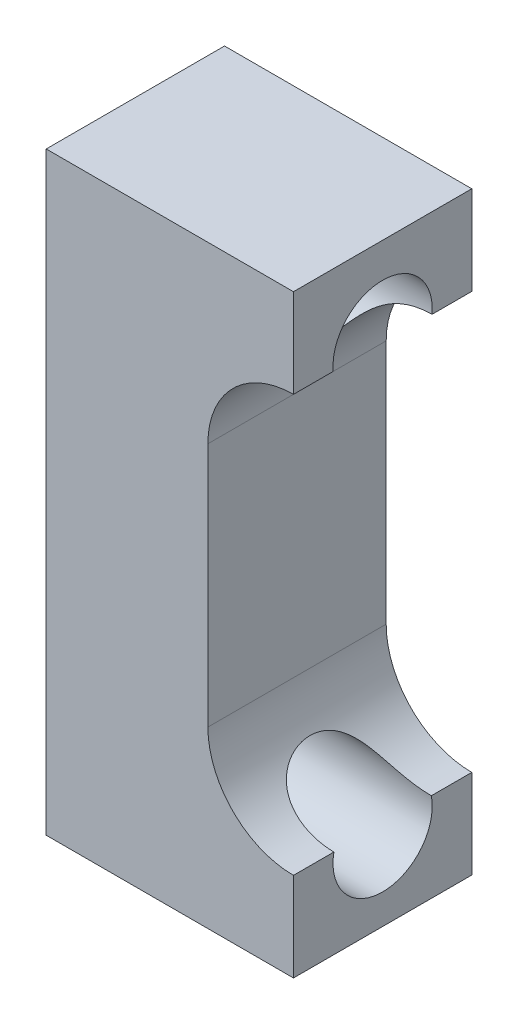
ISO-10303-21;
HEADER;
FILE_DESCRIPTION(('STEP AP214'),'2;1');
FILE_NAME('part.step','',(''),(''),'','','');
FILE_SCHEMA(('AUTOMOTIVE_DESIGN { 1 0 10303 214 1 1 1 1 }'));
ENDSEC;
DATA;
#1=APPLICATION_CONTEXT('core data for automotive mechanical design processes');
#2=APPLICATION_PROTOCOL_DEFINITION('international standard','automotive_design',2000,#1);
#3=PRODUCT_CONTEXT('',#1,'mechanical');
#4=PRODUCT('Part','Part','',(#3));
#5=PRODUCT_RELATED_PRODUCT_CATEGORY('part','',(#4));
#6=PRODUCT_DEFINITION_FORMATION('','',#4);
#7=PRODUCT_DEFINITION_CONTEXT('part definition',#1,'design');
#8=PRODUCT_DEFINITION('design','',#6,#7);
#9=PRODUCT_DEFINITION_SHAPE('','',#8);
#10=(LENGTH_UNIT() NAMED_UNIT(*) SI_UNIT(.MILLI.,.METRE.));
#11=(NAMED_UNIT(*) PLANE_ANGLE_UNIT() SI_UNIT($,.RADIAN.));
#12=(NAMED_UNIT(*) SI_UNIT($,.STERADIAN.) SOLID_ANGLE_UNIT());
#13=UNCERTAINTY_MEASURE_WITH_UNIT(LENGTH_MEASURE(1.E-05),#10,'distance_accuracy_value','');
#14=(GEOMETRIC_REPRESENTATION_CONTEXT(3) GLOBAL_UNCERTAINTY_ASSIGNED_CONTEXT((#13)) GLOBAL_UNIT_ASSIGNED_CONTEXT((#10,
#11,#12)) REPRESENTATION_CONTEXT('',''));
#15=CARTESIAN_POINT('',(0.,0.,0.));
#16=DIRECTION('',(0.,0.,1.));
#17=DIRECTION('',(1.,0.,0.));
#18=AXIS2_PLACEMENT_3D('',#15,#16,#17);
#19=CARTESIAN_POINT('',(11.9999999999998,15.9999999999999,4.7625));
#20=DIRECTION('',(-1.,0.,0.));
#21=DIRECTION('',(0.,-1.,0.));
#22=AXIS2_PLACEMENT_3D('',#19,#20,#21);
#23=PLANE('',#22);
#24=DIRECTION('',(0.,1.,0.));
#25=VECTOR('',#24,1.);
#26=CARTESIAN_POINT('',(12.,16.,-4.7625));
#27=LINE('',#26,#25);
#28=CARTESIAN_POINT('',(12.,-15.75,-4.7625));
#29=VERTEX_POINT('',#28);
#30=CARTESIAN_POINT('',(12.,-11.0002,-4.76249999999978));
#31=VERTEX_POINT('',#30);
#32=EDGE_CURVE('E148',#29,#31,#27,.T.);
#33=ORIENTED_EDGE('',*,*,#32,.T.);
#34=DIRECTION('',(0.,0.,1.));
#35=VECTOR('',#34,1.);
#36=CARTESIAN_POINT('',(12.,-11.0002,-4.76249999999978));
#37=LINE('',#36,#35);
#38=CARTESIAN_POINT('',(11.9999999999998,-11.0002,-2.60244115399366));
#39=VERTEX_POINT('',#38);
#40=EDGE_CURVE('E232',#31,#39,#37,.T.);
#41=ORIENTED_EDGE('',*,*,#40,.T.);
#42=CARTESIAN_POINT('',(12.,-11.5,1.11022302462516E-13));
#43=DIRECTION('',(-1.,0.,0.));
#44=DIRECTION('',(0.,0.,1.));
#45=AXIS2_PLACEMENT_3D('',#42,#43,#44);
#46=CIRCLE('',#45,2.64999999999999);
#47=CARTESIAN_POINT('',(12.0000000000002,-11.0002,2.60244115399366));
#48=VERTEX_POINT('',#47);
#49=EDGE_CURVE('E242',#39,#48,#46,.T.);
#50=ORIENTED_EDGE('',*,*,#49,.T.);
#51=CARTESIAN_POINT('',(11.9999999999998,-11.0002,4.7625));
#52=VERTEX_POINT('',#51);
#53=EDGE_CURVE('E234',#48,#52,#37,.T.);
#54=ORIENTED_EDGE('',*,*,#53,.T.);
#55=DIRECTION('',(0.,1.,0.));
#56=VECTOR('',#55,1.);
#57=CARTESIAN_POINT('',(11.9999999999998,15.9999999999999,4.7625));
#58=LINE('',#57,#56);
#59=CARTESIAN_POINT('',(12.,-15.75,4.76250000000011));
#60=VERTEX_POINT('',#59);
#61=EDGE_CURVE('E159',#60,#52,#58,.T.);
#62=ORIENTED_EDGE('',*,*,#61,.F.);
#63=DIRECTION('',(0.,0.,-1.));
#64=VECTOR('',#63,1.);
#65=CARTESIAN_POINT('',(12.,-15.75,4.76250000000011));
#66=LINE('',#65,#64);
#67=EDGE_CURVE('E158',#60,#29,#66,.T.);
#68=ORIENTED_EDGE('',*,*,#67,.T.);
#69=EDGE_LOOP('',(#33,#41,#50,#54,#62,#68));
#70=FACE_BOUND('',#69,.T.);
#71=ADVANCED_FACE('F38',(#70),#23,.F.);
#72=CARTESIAN_POINT('',(0.,16.,4.7625));
#73=DIRECTION('',(0.,-1.,0.));
#74=DIRECTION('',(0.,0.,-1.));
#75=AXIS2_PLACEMENT_3D('',#72,#73,#74);
#76=PLANE('',#75);
#77=DIRECTION('',(-1.,0.,0.));
#78=VECTOR('',#77,1.);
#79=CARTESIAN_POINT('',(0.,16.,-4.76249999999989));
#80=LINE('',#79,#78);
#81=CARTESIAN_POINT('',(12.,16.,-4.7625));
#82=VERTEX_POINT('',#81);
#83=CARTESIAN_POINT('',(-1.2080000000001,16.,-4.76249999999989));
#84=VERTEX_POINT('',#83);
#85=EDGE_CURVE('E146',#82,#84,#80,.T.);
#86=ORIENTED_EDGE('',*,*,#85,.T.);
#87=DIRECTION('',(0.,0.,-1.));
#88=VECTOR('',#87,1.);
#89=CARTESIAN_POINT('',(-1.2080000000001,16.,4.7625));
#90=LINE('',#89,#88);
#91=CARTESIAN_POINT('',(-1.2080000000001,16.,4.7625));
#92=VERTEX_POINT('',#91);
#93=EDGE_CURVE('E165',#92,#84,#90,.T.);
#94=ORIENTED_EDGE('',*,*,#93,.F.);
#95=DIRECTION('',(-1.,0.,0.));
#96=VECTOR('',#95,1.);
#97=CARTESIAN_POINT('',(0.,16.,4.7625));
#98=LINE('',#97,#96);
#99=CARTESIAN_POINT('',(11.9999999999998,15.9999999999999,4.7625));
#100=VERTEX_POINT('',#99);
#101=EDGE_CURVE('E93',#100,#92,#98,.T.);
#102=ORIENTED_EDGE('',*,*,#101,.F.);
#103=DIRECTION('',(0.,0.,-1.));
#104=VECTOR('',#103,1.);
#105=CARTESIAN_POINT('',(11.9999999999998,15.9999999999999,4.7625));
#106=LINE('',#105,#104);
#107=EDGE_CURVE('E156',#100,#82,#106,.T.);
#108=ORIENTED_EDGE('',*,*,#107,.T.);
#109=EDGE_LOOP('',(#86,#94,#102,#108));
#110=FACE_BOUND('',#109,.T.);
#111=ADVANCED_FACE('F40',(#110),#76,.F.);
#112=CARTESIAN_POINT('',(-1.2080000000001,16.,4.7625));
#113=DIRECTION('',(1.,0.,0.));
#114=DIRECTION('',(0.,1.,0.));
#115=AXIS2_PLACEMENT_3D('',#112,#113,#114);
#116=PLANE('',#115);
#117=CARTESIAN_POINT('',(-1.20800000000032,11.5,1.11022302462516E-13));
#118=DIRECTION('',(1.,0.,0.));
#119=DIRECTION('',(0.,1.,0.));
#120=AXIS2_PLACEMENT_3D('',#117,#118,#119);
#121=CIRCLE('',#120,2.64999999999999);
#122=CARTESIAN_POINT('',(-1.20800000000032,14.15,1.11084362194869E-13));
#123=VERTEX_POINT('',#122);
#124=EDGE_CURVE('E239',#123,#123,#121,.T.);
#125=ORIENTED_EDGE('',*,*,#124,.T.);
#126=EDGE_LOOP('',(#125));
#127=FACE_BOUND('',#126,.T.);
#128=CARTESIAN_POINT('',(-1.20799999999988,-11.5,1.11022302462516E-13));
#129=DIRECTION('',(1.,0.,0.));
#130=DIRECTION('',(0.,1.,0.));
#131=AXIS2_PLACEMENT_3D('',#128,#129,#130);
#132=CIRCLE('',#131,2.64999999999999);
#133=CARTESIAN_POINT('',(-1.20799999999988,-8.84999999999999,1.11084362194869E-13));
#134=VERTEX_POINT('',#133);
#135=EDGE_CURVE('E245',#134,#134,#132,.T.);
#136=ORIENTED_EDGE('',*,*,#135,.T.);
#137=EDGE_LOOP('',(#136));
#138=FACE_BOUND('',#137,.T.);
#139=DIRECTION('',(0.,-1.,0.));
#140=VECTOR('',#139,1.);
#141=CARTESIAN_POINT('',(-1.2080000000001,16.,-4.76249999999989));
#142=LINE('',#141,#140);
#143=CARTESIAN_POINT('',(-1.20799999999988,-15.75,-4.76249999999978));
#144=VERTEX_POINT('',#143);
#145=EDGE_CURVE('E152',#84,#144,#142,.T.);
#146=ORIENTED_EDGE('',*,*,#145,.T.);
#147=DIRECTION('',(0.,0.,-1.));
#148=VECTOR('',#147,1.);
#149=CARTESIAN_POINT('',(-1.2080000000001,-15.75,4.76250000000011));
#150=LINE('',#149,#148);
#151=CARTESIAN_POINT('',(-1.2080000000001,-15.75,4.76250000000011));
#152=VERTEX_POINT('',#151);
#153=EDGE_CURVE('E162',#152,#144,#150,.T.);
#154=ORIENTED_EDGE('',*,*,#153,.F.);
#155=DIRECTION('',(0.,-1.,0.));
#156=VECTOR('',#155,1.);
#157=CARTESIAN_POINT('',(-1.2080000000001,16.,4.7625));
#158=LINE('',#157,#156);
#159=EDGE_CURVE('E249',#92,#152,#158,.T.);
#160=ORIENTED_EDGE('',*,*,#159,.F.);
#161=ORIENTED_EDGE('',*,*,#93,.T.);
#162=EDGE_LOOP('',(#146,#154,#160,#161));
#163=FACE_BOUND('',#162,.T.);
#164=ADVANCED_FACE('F195',(#127,#138,#163),#116,.F.);
#165=CARTESIAN_POINT('',(0.,-15.75,4.7625));
#166=DIRECTION('',(0.,1.,0.));
#167=DIRECTION('',(0.,0.,1.));
#168=AXIS2_PLACEMENT_3D('',#165,#166,#167);
#169=PLANE('',#168);
#170=DIRECTION('',(1.,0.,0.));
#171=VECTOR('',#170,1.);
#172=CARTESIAN_POINT('',(0.,-15.75,-4.76249999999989));
#173=LINE('',#172,#171);
#174=EDGE_CURVE('E149',#144,#29,#173,.T.);
#175=ORIENTED_EDGE('',*,*,#174,.T.);
#176=ORIENTED_EDGE('',*,*,#67,.F.);
#177=DIRECTION('',(1.,0.,0.));
#178=VECTOR('',#177,1.);
#179=CARTESIAN_POINT('',(-1.2080000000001,-15.75,4.76250000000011));
#180=LINE('',#179,#178);
#181=EDGE_CURVE('E251',#152,#60,#180,.T.);
#182=ORIENTED_EDGE('',*,*,#181,.F.);
#183=ORIENTED_EDGE('',*,*,#153,.T.);
#184=EDGE_LOOP('',(#175,#176,#182,#183));
#185=FACE_BOUND('',#184,.T.);
#186=ADVANCED_FACE('F201',(#185),#169,.F.);
#187=CARTESIAN_POINT('',(12.,11.2502,4.7625));
#188=VERTEX_POINT('',#187);
#189=EDGE_CURVE('E67',#188,#100,#58,.T.);
#190=ORIENTED_EDGE('',*,*,#189,.F.);
#191=DIRECTION('',(0.,0.,1.));
#192=VECTOR('',#191,1.);
#193=CARTESIAN_POINT('',(12.,11.2502,-4.76249999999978));
#194=LINE('',#193,#192);
#195=CARTESIAN_POINT('',(12.,11.2502,2.63820013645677));
#196=VERTEX_POINT('',#195);
#197=EDGE_CURVE('E141',#196,#188,#194,.T.);
#198=ORIENTED_EDGE('',*,*,#197,.F.);
#199=CARTESIAN_POINT('',(12.,11.5,1.11022302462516E-13));
#200=DIRECTION('',(-1.,0.,0.));
#201=DIRECTION('',(0.,0.,1.));
#202=AXIS2_PLACEMENT_3D('',#199,#200,#201);
#203=CIRCLE('',#202,2.64999999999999);
#204=CARTESIAN_POINT('',(12.,11.2502,-2.63820013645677));
#205=VERTEX_POINT('',#204);
#206=EDGE_CURVE('E140',#196,#205,#203,.T.);
#207=ORIENTED_EDGE('',*,*,#206,.T.);
#208=CARTESIAN_POINT('',(12.,11.2502,-4.76249999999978));
#209=VERTEX_POINT('',#208);
#210=EDGE_CURVE('E58',#209,#205,#194,.T.);
#211=ORIENTED_EDGE('',*,*,#210,.F.);
#212=EDGE_CURVE('E88',#209,#82,#27,.T.);
#213=ORIENTED_EDGE('',*,*,#212,.T.);
#214=ORIENTED_EDGE('',*,*,#107,.F.);
#215=EDGE_LOOP('',(#190,#198,#207,#211,#213,#214));
#216=FACE_BOUND('',#215,.T.);
#217=ADVANCED_FACE('F137',(#216),#23,.F.);
#218=CARTESIAN_POINT('',(11.9999999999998,15.9999999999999,4.7625));
#219=DIRECTION('',(0.,0.,-1.));
#220=DIRECTION('',(-1.,0.,0.));
#221=AXIS2_PLACEMENT_3D('',#218,#219,#220);
#222=PLANE('',#221);
#223=ORIENTED_EDGE('',*,*,#61,.T.);
#224=CARTESIAN_POINT('',(12.,-6.42819999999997,4.76249999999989));
#225=DIRECTION('',(0.,0.,1.));
#226=DIRECTION('',(1.,0.,0.));
#227=AXIS2_PLACEMENT_3D('',#224,#225,#226);
#228=CIRCLE('',#227,4.572);
#229=CARTESIAN_POINT('',(7.42799999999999,-6.42820000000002,4.7625));
#230=VERTEX_POINT('',#229);
#231=EDGE_CURVE('E134',#230,#52,#228,.T.);
#232=ORIENTED_EDGE('',*,*,#231,.F.);
#233=DIRECTION('',(0.,-1.,0.));
#234=VECTOR('',#233,1.);
#235=CARTESIAN_POINT('',(7.42799999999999,6.67819999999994,4.7625));
#236=LINE('',#235,#234);
#237=CARTESIAN_POINT('',(7.42799999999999,6.67819999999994,4.7625));
#238=VERTEX_POINT('',#237);
#239=EDGE_CURVE('E228',#238,#230,#236,.T.);
#240=ORIENTED_EDGE('',*,*,#239,.F.);
#241=CARTESIAN_POINT('',(12.0000000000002,6.6782,4.76250000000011));
#242=DIRECTION('',(0.,0.,1.));
#243=DIRECTION('',(1.,0.,0.));
#244=AXIS2_PLACEMENT_3D('',#241,#242,#243);
#245=CIRCLE('',#244,4.572);
#246=EDGE_CURVE('E226',#188,#238,#245,.T.);
#247=ORIENTED_EDGE('',*,*,#246,.F.);
#248=ORIENTED_EDGE('',*,*,#189,.T.);
#249=ORIENTED_EDGE('',*,*,#101,.T.);
#250=ORIENTED_EDGE('',*,*,#159,.T.);
#251=ORIENTED_EDGE('',*,*,#181,.T.);
#252=EDGE_LOOP('',(#223,#232,#240,#247,#248,#249,#250,#251));
#253=FACE_BOUND('',#252,.T.);
#254=ADVANCED_FACE('F200',(#253),#222,.F.);
#255=CARTESIAN_POINT('',(12.,16.,-4.7625));
#256=DIRECTION('',(0.,0.,-1.));
#257=DIRECTION('',(-1.,0.,0.));
#258=AXIS2_PLACEMENT_3D('',#255,#256,#257);
#259=PLANE('',#258);
#260=CARTESIAN_POINT('',(12.,-6.42820000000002,-4.76249999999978));
#261=DIRECTION('',(0.,0.,1.));
#262=DIRECTION('',(1.,0.,0.));
#263=AXIS2_PLACEMENT_3D('',#260,#261,#262);
#264=CIRCLE('',#263,4.572);
#265=CARTESIAN_POINT('',(7.42799999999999,-6.42820000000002,-4.76249999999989));
#266=VERTEX_POINT('',#265);
#267=EDGE_CURVE('E222',#266,#31,#264,.T.);
#268=ORIENTED_EDGE('',*,*,#267,.T.);
#269=ORIENTED_EDGE('',*,*,#32,.F.);
#270=ORIENTED_EDGE('',*,*,#174,.F.);
#271=ORIENTED_EDGE('',*,*,#145,.F.);
#272=ORIENTED_EDGE('',*,*,#85,.F.);
#273=ORIENTED_EDGE('',*,*,#212,.F.);
#274=CARTESIAN_POINT('',(11.9999999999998,6.67820000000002,-4.76249999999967));
#275=DIRECTION('',(0.,0.,1.));
#276=DIRECTION('',(1.,0.,0.));
#277=AXIS2_PLACEMENT_3D('',#274,#275,#276);
#278=CIRCLE('',#277,4.572);
#279=CARTESIAN_POINT('',(7.42800000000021,6.6782,-4.76249999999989));
#280=VERTEX_POINT('',#279);
#281=EDGE_CURVE('E126',#209,#280,#278,.T.);
#282=ORIENTED_EDGE('',*,*,#281,.T.);
#283=DIRECTION('',(0.,-1.,0.));
#284=VECTOR('',#283,1.);
#285=CARTESIAN_POINT('',(7.42800000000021,6.6782,-4.76249999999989));
#286=LINE('',#285,#284);
#287=EDGE_CURVE('E133',#280,#266,#286,.T.);
#288=ORIENTED_EDGE('',*,*,#287,.T.);
#289=EDGE_LOOP('',(#268,#269,#270,#271,#272,#273,#282,#288));
#290=FACE_BOUND('',#289,.T.);
#291=ADVANCED_FACE('F144',(#290),#259,.T.);
#292=CARTESIAN_POINT('',(-13.3999999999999,-11.5,-1.11022302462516E-13));
#293=DIRECTION('',(-1.,0.,0.));
#294=DIRECTION('',(0.,0.,1.));
#295=AXIS2_PLACEMENT_3D('',#292,#293,#294);
#296=CYLINDRICAL_SURFACE('',#295,2.64999999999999);
#297=ORIENTED_EDGE('',*,*,#49,.F.);
#298=CARTESIAN_POINT('',(11.9999999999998,-11.0002,-2.60244115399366));
#299=CARTESIAN_POINT('',(11.8882096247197,-11.0002096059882,-2.60239976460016));
#300=CARTESIAN_POINT('',(11.7764164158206,-10.9961002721,-2.6016522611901));
#301=CARTESIAN_POINT('',(11.5534251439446,-10.9797089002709,-2.59844708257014));
#302=CARTESIAN_POINT('',(11.4422272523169,-10.9674246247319,-2.59598893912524));
#303=CARTESIAN_POINT('',(11.2204897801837,-10.9346600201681,-2.58904545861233));
#304=CARTESIAN_POINT('',(11.1099570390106,-10.9141356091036,-2.5845492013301));
#305=CARTESIAN_POINT('',(10.8908415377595,-10.8650402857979,-2.57292968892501));
#306=CARTESIAN_POINT('',(10.7822585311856,-10.8364703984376,-2.56580676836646));
#307=CARTESIAN_POINT('',(10.5748207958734,-10.7736580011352,-2.54870809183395));
#308=CARTESIAN_POINT('',(10.4757969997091,-10.7399143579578,-2.53895165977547));
#309=CARTESIAN_POINT('',(10.2806888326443,-10.6658921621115,-2.51560540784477));
#310=CARTESIAN_POINT('',(10.1846040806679,-10.6256144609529,-2.50201608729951));
#311=CARTESIAN_POINT('',(9.99628820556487,-10.5390436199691,-2.47005793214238));
#312=CARTESIAN_POINT('',(9.90404811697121,-10.4927656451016,-2.451701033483));
#313=CARTESIAN_POINT('',(9.72395231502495,-10.3947211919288,-2.40908986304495));
#314=CARTESIAN_POINT('',(9.63609529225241,-10.3429563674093,-2.38483736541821));
#315=CARTESIAN_POINT('',(9.48635259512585,-10.2479648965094,-2.33602696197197));
#316=CARTESIAN_POINT('',(9.42334706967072,-10.2057234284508,-2.31297775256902));
#317=CARTESIAN_POINT('',(9.30073203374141,-10.119103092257,-2.26233063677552));
#318=CARTESIAN_POINT('',(9.2411216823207,-10.0747247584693,-2.23473386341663));
#319=CARTESIAN_POINT('',(9.1256915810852,-9.9844485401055,-2.17452211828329));
#320=CARTESIAN_POINT('',(9.06987187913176,-9.93855063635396,-2.14190708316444));
#321=CARTESIAN_POINT('',(8.96245067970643,-9.84602098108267,-2.07128889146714));
#322=CARTESIAN_POINT('',(8.91084698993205,-9.79938962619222,-2.03328856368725));
#323=CARTESIAN_POINT('',(8.81168689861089,-9.7057813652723,-1.9512026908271));
#324=CARTESIAN_POINT('',(8.76417711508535,-9.65880578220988,-1.90705906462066));
#325=CARTESIAN_POINT('',(8.67413576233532,-9.56603186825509,-1.81290723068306));
#326=CARTESIAN_POINT('',(8.63160158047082,-9.52023292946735,-1.76290212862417));
#327=CARTESIAN_POINT('',(8.55170424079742,-9.43087103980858,-1.65710385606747));
#328=CARTESIAN_POINT('',(8.51433987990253,-9.38730757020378,-1.6013120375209));
#329=CARTESIAN_POINT('',(8.4448861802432,-9.30349371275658,-1.48426836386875));
#330=CARTESIAN_POINT('',(8.41279592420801,-9.26324274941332,-1.42301746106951));
#331=CARTESIAN_POINT('',(8.33335352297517,-9.16051901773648,-1.25105435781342));
#332=CARTESIAN_POINT('',(8.29090703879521,-9.10205842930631,-1.13556720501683));
#333=CARTESIAN_POINT('',(8.22060653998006,-9.00175113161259,-0.8935506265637));
#334=CARTESIAN_POINT('',(8.19274948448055,-8.95990096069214,-0.767023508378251));
#335=CARTESIAN_POINT('',(8.1520784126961,-8.89760720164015,-0.51549462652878));
#336=CARTESIAN_POINT('',(8.13840115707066,-8.87594461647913,-0.390932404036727));
#337=CARTESIAN_POINT('',(8.12247725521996,-8.85064357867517,-0.139282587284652));
#338=CARTESIAN_POINT('',(8.12022930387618,-8.84700306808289,-0.0121952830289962));
#339=CARTESIAN_POINT('',(8.12705511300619,-8.85791599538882,0.240489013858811));
#340=CARTESIAN_POINT('',(8.13609351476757,-8.8724126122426,0.366089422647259));
#341=CARTESIAN_POINT('',(8.16579146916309,-8.91873775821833,0.612626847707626));
#342=CARTESIAN_POINT('',(8.18645008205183,-8.95056488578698,0.733564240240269));
#343=CARTESIAN_POINT('',(8.24003672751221,-9.02976270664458,0.967285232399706));
#344=CARTESIAN_POINT('',(8.27295820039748,-9.07712508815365,1.08007315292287));
#345=CARTESIAN_POINT('',(8.35171516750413,-9.18457722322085,1.29448680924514));
#346=CARTESIAN_POINT('',(8.39754857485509,-9.24466491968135,1.39611434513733));
#347=CARTESIAN_POINT('',(8.50274312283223,-9.37427601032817,1.58655595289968));
#348=CARTESIAN_POINT('',(8.56219265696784,-9.44385980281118,1.67527981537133));
#349=CARTESIAN_POINT('',(8.69403184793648,-9.5878319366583,1.83791382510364));
#350=CARTESIAN_POINT('',(8.76642362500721,-9.66222106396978,1.91182154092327));
#351=CARTESIAN_POINT('',(8.92812683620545,-9.81642096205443,2.04924925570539));
#352=CARTESIAN_POINT('',(9.01823087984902,-9.89627058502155,2.11178528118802));
#353=CARTESIAN_POINT('',(9.21004737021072,-10.0523761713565,2.22171716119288));
#354=CARTESIAN_POINT('',(9.31176795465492,-10.1286295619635,2.26910231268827));
#355=CARTESIAN_POINT('',(9.49728449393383,-10.2555771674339,2.34046245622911));
#356=CARTESIAN_POINT('',(9.57896490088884,-10.307802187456,2.36732401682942));
#357=CARTESIAN_POINT('',(9.74682649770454,-10.4076378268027,2.41501700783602));
#358=CARTESIAN_POINT('',(9.83300952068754,-10.4552465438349,2.43584595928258));
#359=CARTESIAN_POINT('',(10.0092745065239,-10.5452392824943,2.47250845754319));
#360=CARTESIAN_POINT('',(10.0993634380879,-10.5876133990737,2.4883326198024));
#361=CARTESIAN_POINT('',(10.282629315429,-10.6665696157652,2.5158779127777));
#362=CARTESIAN_POINT('',(10.3758059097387,-10.7031523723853,2.527599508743));
#363=CARTESIAN_POINT('',(10.5667175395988,-10.7709374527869,2.54798900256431));
#364=CARTESIAN_POINT('',(10.6645076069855,-10.8020059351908,2.55658518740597));
#365=CARTESIAN_POINT('',(10.8621427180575,-10.857534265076,2.57110118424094));
#366=CARTESIAN_POINT('',(10.961987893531,-10.8819936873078,2.57702082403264));
#367=CARTESIAN_POINT('',(11.1630323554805,-10.9241094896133,2.58675786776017));
#368=CARTESIAN_POINT('',(11.2642292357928,-10.9417766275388,2.59057860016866));
#369=CARTESIAN_POINT('',(11.4676005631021,-10.9702558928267,2.59655227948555));
#370=CARTESIAN_POINT('',(11.5697746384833,-10.9810705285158,2.5987058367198));
#371=CARTESIAN_POINT('',(11.7267593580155,-10.9923558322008,2.6009251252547));
#372=CARTESIAN_POINT('',(11.7813965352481,-10.9952986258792,2.60149621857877));
#373=CARTESIAN_POINT('',(11.89068774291,-10.9992197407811,2.60225307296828));
#374=CARTESIAN_POINT('',(11.9453416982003,-11.0002000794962,2.60243922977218));
#375=CARTESIAN_POINT('',(12.0000000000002,-11.0002,2.60244115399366));
#376=B_SPLINE_CURVE_WITH_KNOTS('',3,(#298,#299,#300,#301,#302,#303,#304,#305,#306,#307,#308,
#309,#310,#311,#312,#313,#314,#315,#316,#317,#318,#319,#320,#321,#322,#323,#324,#325,#326,#327,
#328,#329,#330,#331,#332,#333,#334,#335,#336,#337,#338,#339,#340,#341,#342,#343,#344,#345,#346,
#347,#348,#349,#350,#351,#352,#353,#354,#355,#356,#357,#358,#359,#360,#361,#362,#363,#364,#365,
#366,#367,#368,#369,#370,#371,#372,#373,#374,#375),.UNSPECIFIED.,.F.,.F.,(4,2,2,2,2,2,2,2,2,2,2,
2,2,2,2,2,2,2,2,2,2,2,2,2,2,2,2,2,2,2,2,2,2,2,2,2,2,2,4),(0.,0.335297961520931,
0.670687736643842,1.00789616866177,1.34506166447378,1.65997340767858,1.97484414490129,
2.28893405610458,2.60292956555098,2.84056196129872,3.078135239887,3.31571151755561,
3.55316346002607,3.79303586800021,4.03278175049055,4.27247174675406,4.51212001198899,
4.91842405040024,5.32464336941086,5.70434675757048,6.08400678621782,6.46248036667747,
6.84092334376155,7.21916417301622,7.59734390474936,7.97805202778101,8.35882257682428,
8.764276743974,9.17001670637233,9.47143858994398,9.77298416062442,10.0750918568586,
10.3771652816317,10.6857876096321,10.9944297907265,11.3025810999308,11.6106195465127,
11.7747454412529,11.9387025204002),.UNSPECIFIED.);
#377=EDGE_CURVE('E11',#39,#48,#376,.T.);
#378=ORIENTED_EDGE('',*,*,#377,.T.);
#379=EDGE_LOOP('',(#297,#378));
#380=FACE_BOUND('',#379,.T.);
#381=ORIENTED_EDGE('',*,*,#135,.F.);
#382=EDGE_LOOP('',(#381));
#383=FACE_BOUND('',#382,.T.);
#384=ADVANCED_FACE('F187',(#380,#383),#296,.F.);
#385=CARTESIAN_POINT('',(-13.4000000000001,11.5,0.));
#386=DIRECTION('',(-1.,0.,0.));
#387=DIRECTION('',(0.,0.,1.));
#388=AXIS2_PLACEMENT_3D('',#385,#386,#387);
#389=CYLINDRICAL_SURFACE('',#388,2.64999999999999);
#390=ORIENTED_EDGE('',*,*,#206,.F.);
#391=CARTESIAN_POINT('',(12.,11.2502,2.63820013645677));
#392=CARTESIAN_POINT('',(11.8884276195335,11.2502082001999,2.63816005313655));
#393=CARTESIAN_POINT('',(11.776854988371,11.2461161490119,2.63781209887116));
#394=CARTESIAN_POINT('',(11.5543099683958,11.2297901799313,2.63621158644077));
#395=CARTESIAN_POINT('',(11.4433375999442,11.2175559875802,2.63495899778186));
#396=CARTESIAN_POINT('',(11.2216560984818,11.1848649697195,2.63124447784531));
#397=CARTESIAN_POINT('',(11.1109573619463,11.1643386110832,2.628772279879));
#398=CARTESIAN_POINT('',(10.8914210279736,11.115191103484,2.62202980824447));
#399=CARTESIAN_POINT('',(10.7825835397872,11.0865694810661,2.61775942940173));
#400=CARTESIAN_POINT('',(10.5529695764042,11.0170406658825,2.60588926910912));
#401=CARTESIAN_POINT('',(10.4325524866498,10.974999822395,2.59791940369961));
#402=CARTESIAN_POINT('',(10.1959569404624,10.8811523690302,2.57717597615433));
#403=CARTESIAN_POINT('',(10.0797796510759,10.8293430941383,2.56440110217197));
#404=CARTESIAN_POINT('',(9.85336102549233,10.7168915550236,2.53232003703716));
#405=CARTESIAN_POINT('',(9.74309521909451,10.6562902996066,2.51304364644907));
#406=CARTESIAN_POINT('',(9.52928402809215,10.5271358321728,2.46591803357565));
#407=CARTESIAN_POINT('',(9.42573356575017,10.4585887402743,2.43807538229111));
#408=CARTESIAN_POINT('',(9.26516023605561,10.3428323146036,2.38449484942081));
#409=CARTESIAN_POINT('',(9.20559147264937,10.2975858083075,2.36208434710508));
#410=CARTESIAN_POINT('',(9.08988466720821,10.2052219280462,2.31274514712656));
#411=CARTESIAN_POINT('',(9.0337455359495,10.1581051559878,2.28581789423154));
#412=CARTESIAN_POINT('',(8.9252514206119,10.062624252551,2.22701436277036));
#413=CARTESIAN_POINT('',(8.87289589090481,10.0142603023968,2.195138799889));
#414=CARTESIAN_POINT('',(8.77231941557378,9.9170501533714,2.12610459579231));
#415=CARTESIAN_POINT('',(8.72409647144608,9.868204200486,2.08894853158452));
#416=CARTESIAN_POINT('',(8.63163436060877,9.77042658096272,2.00875781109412));
#417=CARTESIAN_POINT('',(8.58743489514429,9.72149808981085,1.96567332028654));
#418=CARTESIAN_POINT('',(8.5037589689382,9.62498820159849,1.87383675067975));
#419=CARTESIAN_POINT('',(8.4642801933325,9.57740615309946,1.82508747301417));
#420=CARTESIAN_POINT('',(8.39014858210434,9.48456549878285,1.72201454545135));
#421=CARTESIAN_POINT('',(8.355495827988,9.43930693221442,1.66769080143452));
#422=CARTESIAN_POINT('',(8.29104259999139,9.35210354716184,1.55376449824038));
#423=CARTESIAN_POINT('',(8.26124148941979,9.31015829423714,1.49416263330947));
#424=CARTESIAN_POINT('',(8.20997269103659,9.23566931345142,1.37819512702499));
#425=CARTESIAN_POINT('',(8.18792541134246,9.2026119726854,1.32241367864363));
#426=CARTESIAN_POINT('',(8.14733396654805,9.14021833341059,1.20756071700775));
#427=CARTESIAN_POINT('',(8.12879100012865,9.11088330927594,1.14848808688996));
#428=CARTESIAN_POINT('',(8.09509794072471,9.0564243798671,1.02753696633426));
#429=CARTESIAN_POINT('',(8.07994611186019,9.03129832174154,0.965659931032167));
#430=CARTESIAN_POINT('',(8.05288090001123,8.98560864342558,0.839550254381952));
#431=CARTESIAN_POINT('',(8.04096871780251,8.96504671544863,0.775316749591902));
#432=CARTESIAN_POINT('',(8.01089259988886,8.91243993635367,0.586129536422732));
#433=CARTESIAN_POINT('',(7.99678103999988,8.88676618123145,0.458665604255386));
#434=CARTESIAN_POINT('',(7.97910089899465,8.85441036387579,0.200709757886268));
#435=CARTESIAN_POINT('',(7.97553196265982,8.84772766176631,0.0702179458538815));
#436=CARTESIAN_POINT('',(7.97872700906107,8.85364498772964,-0.190834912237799));
#437=CARTESIAN_POINT('',(7.98553965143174,8.86633582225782,-0.321393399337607));
#438=CARTESIAN_POINT('',(8.00997194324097,8.91057335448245,-0.578229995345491));
#439=CARTESIAN_POINT('',(8.02759112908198,8.94211924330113,-0.704508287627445));
#440=CARTESIAN_POINT('',(8.07446529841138,9.02244995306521,-0.949104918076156));
#441=CARTESIAN_POINT('',(8.10371392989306,9.07122536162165,-1.0674275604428));
#442=CARTESIAN_POINT('',(8.1748336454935,9.18332821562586,-1.2928135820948));
#443=CARTESIAN_POINT('',(8.21670169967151,9.24665216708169,-1.39987965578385));
#444=CARTESIAN_POINT('',(8.31356408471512,9.38381714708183,-1.5996539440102));
#445=CARTESIAN_POINT('',(8.36850071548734,9.4576113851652,-1.69242239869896));
#446=CARTESIAN_POINT('',(8.49163932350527,9.61150563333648,-1.86259644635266));
#447=CARTESIAN_POINT('',(8.55984256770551,9.69160624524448,-1.94000057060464));
#448=CARTESIAN_POINT('',(8.71183339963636,9.85691868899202,-2.08210590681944));
#449=CARTESIAN_POINT('',(8.79614736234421,9.94220512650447,-2.14615223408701));
#450=CARTESIAN_POINT('',(8.97684095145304,10.1102430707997,-2.25861091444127));
#451=CARTESIAN_POINT('',(9.07322662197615,10.1929932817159,-2.3070153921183));
#452=CARTESIAN_POINT('',(9.24810697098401,10.3304646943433,-2.37885184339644));
#453=CARTESIAN_POINT('',(9.32420678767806,10.3866230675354,-2.40548943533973));
#454=CARTESIAN_POINT('',(9.48105916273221,10.494899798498,-2.45270515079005));
#455=CARTESIAN_POINT('',(9.56181341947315,10.5470166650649,-2.47328104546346));
#456=CARTESIAN_POINT('',(9.72746027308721,10.6465890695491,-2.50938287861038));
#457=CARTESIAN_POINT('',(9.8123616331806,10.6940340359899,-2.52489754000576));
#458=CARTESIAN_POINT('',(9.98554795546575,10.7836449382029,-2.55176856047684));
#459=CARTESIAN_POINT('',(10.0738336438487,10.8258097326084,-2.56312402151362));
#460=CARTESIAN_POINT('',(10.2756299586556,10.9143194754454,-2.58496595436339));
#461=CARTESIAN_POINT('',(10.3899371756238,10.9590815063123,-2.59452830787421));
#462=CARTESIAN_POINT('',(10.6220274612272,11.039331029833,-2.60997191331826));
#463=CARTESIAN_POINT('',(10.7398117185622,11.0748153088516,-2.61585189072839));
#464=CARTESIAN_POINT('',(10.9777820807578,11.1361517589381,-2.62508571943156));
#465=CARTESIAN_POINT('',(11.0979647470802,11.1620168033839,-2.62844295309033));
#466=CARTESIAN_POINT('',(11.3400002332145,11.2039771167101,-2.63349930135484));
#467=CARTESIAN_POINT('',(11.4618521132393,11.2200776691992,-2.63519931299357));
#468=CARTESIAN_POINT('',(11.6533206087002,11.2375669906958,-2.63698045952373));
#469=CARTESIAN_POINT('',(11.7226440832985,11.2423081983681,-2.63744401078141));
#470=CARTESIAN_POINT('',(11.8613093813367,11.2486219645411,-2.6380510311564));
#471=CARTESIAN_POINT('',(11.9306509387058,11.2502003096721,-2.63819508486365));
#472=CARTESIAN_POINT('',(12.,11.2502,-2.63820013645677));
#473=B_SPLINE_CURVE_WITH_KNOTS('',3,(#391,#392,#393,#394,#395,#396,#397,#398,#399,#400,#401,
#402,#403,#404,#405,#406,#407,#408,#409,#410,#411,#412,#413,#414,#415,#416,#417,#418,#419,#420,
#421,#422,#423,#424,#425,#426,#427,#428,#429,#430,#431,#432,#433,#434,#435,#436,#437,#438,#439,
#440,#441,#442,#443,#444,#445,#446,#447,#448,#449,#450,#451,#452,#453,#454,#455,#456,#457,#458,
#459,#460,#461,#462,#463,#464,#465,#466,#467,#468,#469,#470,#471,#472),.UNSPECIFIED.,.F.,.F.,(4,
2,2,2,2,2,2,2,2,2,2,2,2,2,2,2,2,2,2,2,2,2,2,2,2,2,2,2,2,2,2,2,2,2,2,2,2,2,2,2,4),(0.,
0.33464192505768,0.669295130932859,1.00681479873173,1.3443542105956,1.72722019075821,
2.11019077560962,2.4914292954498,2.87237610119,3.10644696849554,3.34044310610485,
3.57440543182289,3.80825396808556,4.04420430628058,4.2800384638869,4.51587660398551,
4.75168376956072,4.95688161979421,5.16214953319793,5.36731213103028,5.57255066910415,
5.96290976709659,6.35325571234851,6.74543688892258,7.13760124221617,7.52955168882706,
7.9214081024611,8.31156550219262,8.70176018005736,9.10803365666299,9.51451136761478,
9.80891065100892,10.1034180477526,10.3985772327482,10.6938001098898,11.0627003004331,
11.4317281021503,11.8002602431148,12.1685927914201,12.3769884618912,12.5850025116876),.UNSPECIFIED.);
#474=EDGE_CURVE('E51',#196,#205,#473,.T.);
#475=ORIENTED_EDGE('',*,*,#474,.T.);
#476=EDGE_LOOP('',(#390,#475));
#477=FACE_BOUND('',#476,.T.);
#478=ORIENTED_EDGE('',*,*,#124,.F.);
#479=EDGE_LOOP('',(#478));
#480=FACE_BOUND('',#479,.T.);
#481=ADVANCED_FACE('F172',(#477,#480),#389,.F.);
#482=CARTESIAN_POINT('',(12.,-6.42820000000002,-4.76249999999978));
#483=DIRECTION('',(0.,0.,1.));
#484=DIRECTION('',(1.,0.,0.));
#485=AXIS2_PLACEMENT_3D('',#482,#483,#484);
#486=CYLINDRICAL_SURFACE('',#485,4.572);
#487=ORIENTED_EDGE('',*,*,#40,.F.);
#488=ORIENTED_EDGE('',*,*,#267,.F.);
#489=DIRECTION('',(0.,0.,1.));
#490=VECTOR('',#489,1.);
#491=CARTESIAN_POINT('',(7.42799999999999,-6.42820000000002,-4.76249999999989));
#492=LINE('',#491,#490);
#493=EDGE_CURVE('E235',#266,#230,#492,.T.);
#494=ORIENTED_EDGE('',*,*,#493,.T.);
#495=ORIENTED_EDGE('',*,*,#231,.T.);
#496=ORIENTED_EDGE('',*,*,#53,.F.);
#497=ORIENTED_EDGE('',*,*,#377,.F.);
#498=EDGE_LOOP('',(#487,#488,#494,#495,#496,#497));
#499=FACE_BOUND('',#498,.T.);
#500=ADVANCED_FACE('F178',(#499),#486,.F.);
#501=CARTESIAN_POINT('',(11.9999999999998,6.67820000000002,-4.76249999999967));
#502=DIRECTION('',(0.,0.,1.));
#503=DIRECTION('',(1.,0.,0.));
#504=AXIS2_PLACEMENT_3D('',#501,#502,#503);
#505=CYLINDRICAL_SURFACE('',#504,4.572);
#506=ORIENTED_EDGE('',*,*,#197,.T.);
#507=ORIENTED_EDGE('',*,*,#246,.T.);
#508=DIRECTION('',(0.,0.,1.));
#509=VECTOR('',#508,1.);
#510=CARTESIAN_POINT('',(7.42800000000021,6.6782,-4.76249999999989));
#511=LINE('',#510,#509);
#512=EDGE_CURVE('E129',#280,#238,#511,.T.);
#513=ORIENTED_EDGE('',*,*,#512,.F.);
#514=ORIENTED_EDGE('',*,*,#281,.F.);
#515=ORIENTED_EDGE('',*,*,#210,.T.);
#516=ORIENTED_EDGE('',*,*,#474,.F.);
#517=EDGE_LOOP('',(#506,#507,#513,#514,#515,#516));
#518=FACE_BOUND('',#517,.T.);
#519=ADVANCED_FACE('F127',(#518),#505,.F.);
#520=CARTESIAN_POINT('',(7.42800000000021,6.6782,-4.76249999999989));
#521=DIRECTION('',(-1.,0.,0.));
#522=DIRECTION('',(0.,-1.,0.));
#523=AXIS2_PLACEMENT_3D('',#520,#521,#522);
#524=PLANE('',#523);
#525=ORIENTED_EDGE('',*,*,#239,.T.);
#526=ORIENTED_EDGE('',*,*,#493,.F.);
#527=ORIENTED_EDGE('',*,*,#287,.F.);
#528=ORIENTED_EDGE('',*,*,#512,.T.);
#529=EDGE_LOOP('',(#525,#526,#527,#528));
#530=FACE_BOUND('',#529,.T.);
#531=ADVANCED_FACE('F177',(#530),#524,.F.);
#532=CLOSED_SHELL('',(#71,#111,#164,#186,#217,#254,#291,#384,#481,#500,#519,#531));
#533=MANIFOLD_SOLID_BREP('B2',#532);
#534=ADVANCED_BREP_SHAPE_REPRESENTATION('',(#18,#533),#14);
#535=SHAPE_DEFINITION_REPRESENTATION(#9,#534);
ENDSEC;
END-ISO-10303-21;
